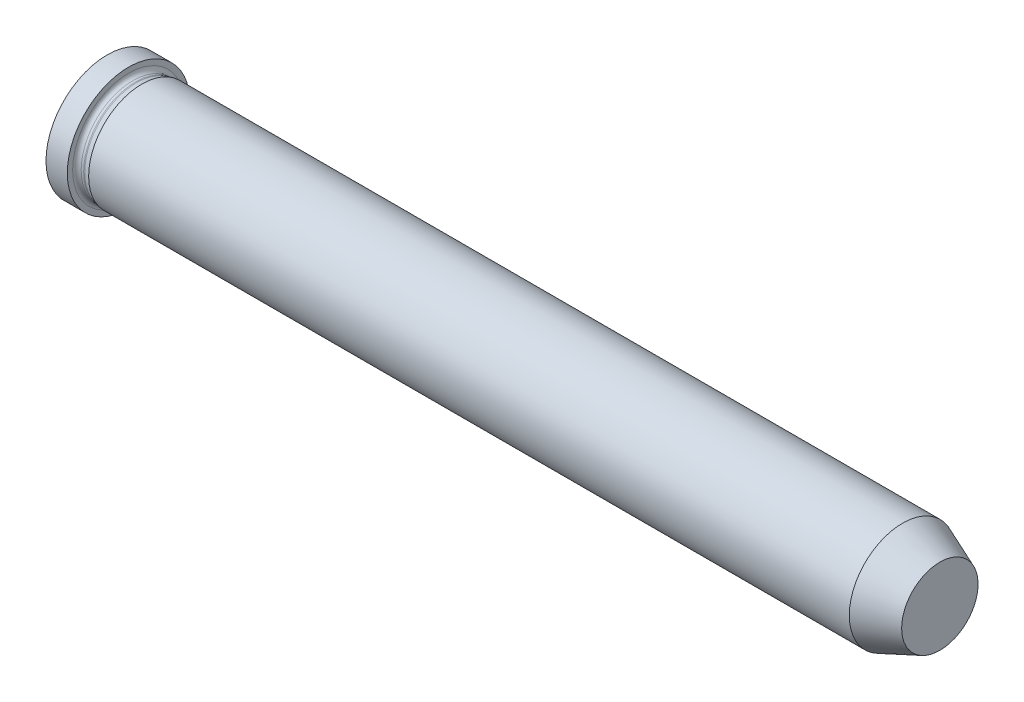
ISO-10303-21;
HEADER;
FILE_DESCRIPTION(('STEP AP214'),'2;1');
FILE_NAME('part.step','',(''),(''),'','','');
FILE_SCHEMA(('AUTOMOTIVE_DESIGN { 1 0 10303 214 1 1 1 1 }'));
ENDSEC;
DATA;
#1=APPLICATION_CONTEXT('core data for automotive mechanical design processes');
#2=APPLICATION_PROTOCOL_DEFINITION('international standard','automotive_design',2000,#1);
#3=PRODUCT_CONTEXT('',#1,'mechanical');
#4=PRODUCT('Part','Part','',(#3));
#5=PRODUCT_RELATED_PRODUCT_CATEGORY('part','',(#4));
#6=PRODUCT_DEFINITION_FORMATION('','',#4);
#7=PRODUCT_DEFINITION_CONTEXT('part definition',#1,'design');
#8=PRODUCT_DEFINITION('design','',#6,#7);
#9=PRODUCT_DEFINITION_SHAPE('','',#8);
#10=(LENGTH_UNIT() NAMED_UNIT(*) SI_UNIT(.MILLI.,.METRE.));
#11=(NAMED_UNIT(*) PLANE_ANGLE_UNIT() SI_UNIT($,.RADIAN.));
#12=(NAMED_UNIT(*) SI_UNIT($,.STERADIAN.) SOLID_ANGLE_UNIT());
#13=UNCERTAINTY_MEASURE_WITH_UNIT(LENGTH_MEASURE(1.E-05),#10,'distance_accuracy_value','');
#14=(GEOMETRIC_REPRESENTATION_CONTEXT(3) GLOBAL_UNCERTAINTY_ASSIGNED_CONTEXT((#13)) GLOBAL_UNIT_ASSIGNED_CONTEXT((#10,
#11,#12)) REPRESENTATION_CONTEXT('',''));
#15=CARTESIAN_POINT('',(0.,0.,0.));
#16=DIRECTION('',(0.,0.,1.));
#17=DIRECTION('',(1.,0.,0.));
#18=AXIS2_PLACEMENT_3D('',#15,#16,#17);
#19=CARTESIAN_POINT('',(5.27582587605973,0.,0.));
#20=DIRECTION('',(-1.,0.,0.));
#21=DIRECTION('',(0.,0.,1.));
#22=AXIS2_PLACEMENT_3D('',#19,#20,#21);
#23=TOROIDAL_SURFACE('',#22,10.5,0.8);
#24=CARTESIAN_POINT('',(5.5,0.,0.));
#25=DIRECTION('',(-1.,0.,0.));
#26=DIRECTION('',(0.,0.,1.));
#27=AXIS2_PLACEMENT_3D('',#24,#25,#26);
#28=CIRCLE('',#27,9.73205080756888);
#29=CARTESIAN_POINT('',(5.5,0.,9.73205080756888));
#30=VERTEX_POINT('',#29);
#31=EDGE_CURVE('E95',#30,#30,#28,.T.);
#32=ORIENTED_EDGE('',*,*,#31,.T.);
#33=EDGE_LOOP('',(#32));
#34=FACE_BOUND('',#33,.T.);
#35=CARTESIAN_POINT('',(5.27582587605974,0.,0.));
#36=DIRECTION('',(-1.,0.,0.));
#37=DIRECTION('',(0.,0.,1.));
#38=AXIS2_PLACEMENT_3D('',#35,#36,#37);
#39=CIRCLE('',#38,9.7);
#40=CARTESIAN_POINT('',(5.27582587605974,0.,9.7));
#41=VERTEX_POINT('',#40);
#42=EDGE_CURVE('E10',#41,#41,#39,.T.);
#43=ORIENTED_EDGE('',*,*,#42,.F.);
#44=EDGE_LOOP('',(#43));
#45=FACE_BOUND('',#44,.T.);
#46=ADVANCED_FACE('F16',(#34,#45),#23,.F.);
#47=CARTESIAN_POINT('',(0.,0.,0.));
#48=DIRECTION('',(-1.,0.,0.));
#49=DIRECTION('',(0.,0.,1.));
#50=AXIS2_PLACEMENT_3D('',#47,#48,#49);
#51=CYLINDRICAL_SURFACE('',#50,9.7);
#52=ORIENTED_EDGE('',*,*,#42,.T.);
#53=EDGE_LOOP('',(#52));
#54=FACE_BOUND('',#53,.T.);
#55=CARTESIAN_POINT('',(4.8,0.,0.));
#56=DIRECTION('',(-1.,0.,0.));
#57=DIRECTION('',(0.,0.,1.));
#58=AXIS2_PLACEMENT_3D('',#55,#56,#57);
#59=CIRCLE('',#58,9.7);
#60=CARTESIAN_POINT('',(4.8,0.,9.7));
#61=VERTEX_POINT('',#60);
#62=EDGE_CURVE('E22',#61,#61,#59,.T.);
#63=ORIENTED_EDGE('',*,*,#62,.F.);
#64=EDGE_LOOP('',(#63));
#65=FACE_BOUND('',#64,.T.);
#66=ADVANCED_FACE('F52',(#54,#65),#51,.T.);
#67=CARTESIAN_POINT('',(4.8,0.,0.));
#68=DIRECTION('',(-1.,0.,0.));
#69=DIRECTION('',(0.,0.,1.));
#70=AXIS2_PLACEMENT_3D('',#67,#68,#69);
#71=TOROIDAL_SURFACE('',#70,10.5,0.8);
#72=CARTESIAN_POINT('',(4.,0.,0.));
#73=DIRECTION('',(-1.,0.,0.));
#74=DIRECTION('',(0.,0.,1.));
#75=AXIS2_PLACEMENT_3D('',#72,#73,#74);
#76=CIRCLE('',#75,10.5);
#77=CARTESIAN_POINT('',(4.,0.,10.5));
#78=VERTEX_POINT('',#77);
#79=EDGE_CURVE('E39',#78,#78,#76,.T.);
#80=ORIENTED_EDGE('',*,*,#79,.F.);
#81=EDGE_LOOP('',(#80));
#82=FACE_BOUND('',#81,.T.);
#83=ORIENTED_EDGE('',*,*,#62,.T.);
#84=EDGE_LOOP('',(#83));
#85=FACE_BOUND('',#84,.T.);
#86=ADVANCED_FACE('F50',(#82,#85),#71,.F.);
#87=CARTESIAN_POINT('',(4.,0.,0.));
#88=DIRECTION('',(1.,0.,0.));
#89=DIRECTION('',(0.,0.,-1.));
#90=AXIS2_PLACEMENT_3D('',#87,#88,#89);
#91=PLANE('',#90);
#92=ORIENTED_EDGE('',*,*,#79,.T.);
#93=EDGE_LOOP('',(#92));
#94=FACE_BOUND('',#93,.T.);
#95=CARTESIAN_POINT('',(4.,0.,0.));
#96=DIRECTION('',(-1.,0.,0.));
#97=DIRECTION('',(0.,0.,1.));
#98=AXIS2_PLACEMENT_3D('',#95,#96,#97);
#99=CIRCLE('',#98,11.5);
#100=CARTESIAN_POINT('',(4.,0.,11.5));
#101=VERTEX_POINT('',#100);
#102=EDGE_CURVE('E35',#101,#101,#99,.T.);
#103=ORIENTED_EDGE('',*,*,#102,.F.);
#104=EDGE_LOOP('',(#103));
#105=FACE_BOUND('',#104,.T.);
#106=ADVANCED_FACE('F61',(#94,#105),#91,.T.);
#107=CARTESIAN_POINT('',(0.,0.,0.));
#108=DIRECTION('',(-1.,0.,0.));
#109=DIRECTION('',(0.,0.,1.));
#110=AXIS2_PLACEMENT_3D('',#107,#108,#109);
#111=CYLINDRICAL_SURFACE('',#110,11.5);
#112=ORIENTED_EDGE('',*,*,#102,.T.);
#113=EDGE_LOOP('',(#112));
#114=FACE_BOUND('',#113,.T.);
#115=CARTESIAN_POINT('',(0.,0.,0.));
#116=DIRECTION('',(-1.,0.,0.));
#117=DIRECTION('',(0.,0.,1.));
#118=AXIS2_PLACEMENT_3D('',#115,#116,#117);
#119=CIRCLE('',#118,11.5);
#120=CARTESIAN_POINT('',(0.,0.,11.5));
#121=VERTEX_POINT('',#120);
#122=EDGE_CURVE('E33',#121,#121,#119,.T.);
#123=ORIENTED_EDGE('',*,*,#122,.F.);
#124=EDGE_LOOP('',(#123));
#125=FACE_BOUND('',#124,.T.);
#126=ADVANCED_FACE('F29',(#114,#125),#111,.T.);
#127=CARTESIAN_POINT('',(0.,0.,0.));
#128=DIRECTION('',(1.,0.,0.));
#129=DIRECTION('',(0.,0.,-1.));
#130=AXIS2_PLACEMENT_3D('',#127,#128,#129);
#131=CONICAL_SURFACE('',#130,11.5,1.25663706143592);
#132=CARTESIAN_POINT('',(-3.73657650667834,0.,0.));
#133=VERTEX_POINT('',#132);
#134=VERTEX_LOOP('',#133);
#135=FACE_BOUND('',#134,.T.);
#136=ORIENTED_EDGE('',*,*,#122,.T.);
#137=EDGE_LOOP('',(#136));
#138=FACE_BOUND('',#137,.T.);
#139=ADVANCED_FACE('F25',(#135,#138),#131,.T.);
#140=CARTESIAN_POINT('',(156.263423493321,0.,0.));
#141=DIRECTION('',(1.,0.,0.));
#142=DIRECTION('',(0.,0.,-1.));
#143=AXIS2_PLACEMENT_3D('',#140,#141,#142);
#144=PLANE('',#143);
#145=CARTESIAN_POINT('',(156.263423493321,0.,0.));
#146=DIRECTION('',(-1.,0.,0.));
#147=DIRECTION('',(0.,0.,1.));
#148=AXIS2_PLACEMENT_3D('',#145,#146,#147);
#149=CIRCLE('',#148,7.17181641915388);
#150=CARTESIAN_POINT('',(156.263423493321,0.,7.17181641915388));
#151=VERTEX_POINT('',#150);
#152=EDGE_CURVE('E36',#151,#151,#149,.T.);
#153=ORIENTED_EDGE('',*,*,#152,.F.);
#154=EDGE_LOOP('',(#153));
#155=FACE_BOUND('',#154,.T.);
#156=ADVANCED_FACE('F28',(#155),#144,.T.);
#157=CARTESIAN_POINT('',(149.263423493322,0.,0.));
#158=DIRECTION('',(-1.,0.,0.));
#159=DIRECTION('',(0.,0.,1.));
#160=AXIS2_PLACEMENT_3D('',#157,#158,#159);
#161=CONICAL_SURFACE('',#160,10.,0.383972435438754);
#162=ORIENTED_EDGE('',*,*,#152,.T.);
#163=EDGE_LOOP('',(#162));
#164=FACE_BOUND('',#163,.T.);
#165=CARTESIAN_POINT('',(149.263423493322,0.,0.));
#166=DIRECTION('',(-1.,0.,0.));
#167=DIRECTION('',(0.,0.,1.));
#168=AXIS2_PLACEMENT_3D('',#165,#166,#167);
#169=CIRCLE('',#168,10.);
#170=CARTESIAN_POINT('',(149.263423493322,0.,10.));
#171=VERTEX_POINT('',#170);
#172=EDGE_CURVE('E42',#171,#171,#169,.T.);
#173=ORIENTED_EDGE('',*,*,#172,.F.);
#174=EDGE_LOOP('',(#173));
#175=FACE_BOUND('',#174,.T.);
#176=ADVANCED_FACE('F74',(#164,#175),#161,.T.);
#177=CARTESIAN_POINT('',(0.,0.,0.));
#178=DIRECTION('',(-1.,0.,0.));
#179=DIRECTION('',(0.,0.,1.));
#180=AXIS2_PLACEMENT_3D('',#177,#178,#179);
#181=CYLINDRICAL_SURFACE('',#180,10.);
#182=ORIENTED_EDGE('',*,*,#172,.T.);
#183=EDGE_LOOP('',(#182));
#184=FACE_BOUND('',#183,.T.);
#185=CARTESIAN_POINT('',(6.5,0.,0.));
#186=DIRECTION('',(-1.,0.,0.));
#187=DIRECTION('',(0.,0.,1.));
#188=AXIS2_PLACEMENT_3D('',#185,#186,#187);
#189=CIRCLE('',#188,10.);
#190=CARTESIAN_POINT('',(6.5,0.,10.));
#191=VERTEX_POINT('',#190);
#192=EDGE_CURVE('E92',#191,#191,#189,.T.);
#193=ORIENTED_EDGE('',*,*,#192,.F.);
#194=EDGE_LOOP('',(#193));
#195=FACE_BOUND('',#194,.T.);
#196=ADVANCED_FACE('F78',(#184,#195),#181,.T.);
#197=CARTESIAN_POINT('',(5.5,0.,0.));
#198=DIRECTION('',(1.,0.,0.));
#199=DIRECTION('',(0.,0.,-1.));
#200=AXIS2_PLACEMENT_3D('',#197,#198,#199);
#201=CONICAL_SURFACE('',#200,9.73205080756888,0.26179938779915);
#202=ORIENTED_EDGE('',*,*,#192,.T.);
#203=EDGE_LOOP('',(#202));
#204=FACE_BOUND('',#203,.T.);
#205=ORIENTED_EDGE('',*,*,#31,.F.);
#206=EDGE_LOOP('',(#205));
#207=FACE_BOUND('',#206,.T.);
#208=ADVANCED_FACE('F82',(#204,#207),#201,.T.);
#209=CLOSED_SHELL('',(#46,#66,#86,#106,#126,#139,#156,#176,#196,#208));
#210=MANIFOLD_SOLID_BREP('B1',#209);
#211=ADVANCED_BREP_SHAPE_REPRESENTATION('',(#18,#210),#14);
#212=SHAPE_DEFINITION_REPRESENTATION(#9,#211);
ENDSEC;
END-ISO-10303-21;
